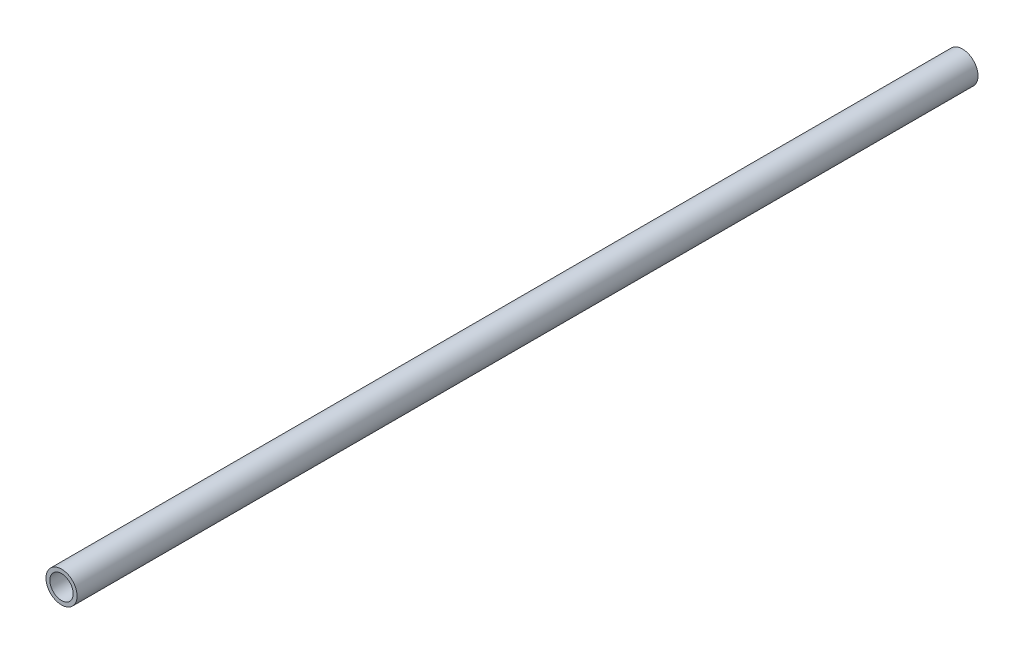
ISO-10303-21;
HEADER;
FILE_DESCRIPTION(('STEP AP214'),'2;1');
FILE_NAME('part.step','',(''),(''),'','','');
FILE_SCHEMA(('AUTOMOTIVE_DESIGN { 1 0 10303 214 1 1 1 1 }'));
ENDSEC;
DATA;
#1=APPLICATION_CONTEXT('core data for automotive mechanical design processes');
#2=APPLICATION_PROTOCOL_DEFINITION('international standard','automotive_design',2000,#1);
#3=PRODUCT_CONTEXT('',#1,'mechanical');
#4=PRODUCT('Part','Part','',(#3));
#5=PRODUCT_RELATED_PRODUCT_CATEGORY('part','',(#4));
#6=PRODUCT_DEFINITION_FORMATION('','',#4);
#7=PRODUCT_DEFINITION_CONTEXT('part definition',#1,'design');
#8=PRODUCT_DEFINITION('design','',#6,#7);
#9=PRODUCT_DEFINITION_SHAPE('','',#8);
#10=(LENGTH_UNIT() NAMED_UNIT(*) SI_UNIT(.MILLI.,.METRE.));
#11=(NAMED_UNIT(*) PLANE_ANGLE_UNIT() SI_UNIT($,.RADIAN.));
#12=(NAMED_UNIT(*) SI_UNIT($,.STERADIAN.) SOLID_ANGLE_UNIT());
#13=UNCERTAINTY_MEASURE_WITH_UNIT(LENGTH_MEASURE(1.E-05),#10,'distance_accuracy_value','');
#14=(GEOMETRIC_REPRESENTATION_CONTEXT(3) GLOBAL_UNCERTAINTY_ASSIGNED_CONTEXT((#13)) GLOBAL_UNIT_ASSIGNED_CONTEXT((#10,
#11,#12)) REPRESENTATION_CONTEXT('',''));
#15=CARTESIAN_POINT('',(0.,0.,0.));
#16=DIRECTION('',(0.,0.,1.));
#17=DIRECTION('',(1.,0.,0.));
#18=AXIS2_PLACEMENT_3D('',#15,#16,#17);
#19=CARTESIAN_POINT('',(0.,0.,579.));
#20=DIRECTION('',(0.,0.,1.));
#21=DIRECTION('',(1.,0.,0.));
#22=AXIS2_PLACEMENT_3D('',#19,#20,#21);
#23=PLANE('',#22);
#24=CARTESIAN_POINT('',(0.,0.,579.));
#25=DIRECTION('',(0.,0.,1.));
#26=DIRECTION('',(1.,0.,0.));
#27=AXIS2_PLACEMENT_3D('',#24,#25,#26);
#28=CIRCLE('',#27,10.);
#29=CARTESIAN_POINT('',(10.,0.,579.));
#30=VERTEX_POINT('',#29);
#31=EDGE_CURVE('E10',#30,#30,#28,.T.);
#32=ORIENTED_EDGE('',*,*,#31,.T.);
#33=EDGE_LOOP('',(#32));
#34=FACE_BOUND('',#33,.T.);
#35=CARTESIAN_POINT('',(0.,0.,579.));
#36=DIRECTION('',(0.,0.,1.));
#37=DIRECTION('',(1.,0.,0.));
#38=AXIS2_PLACEMENT_3D('',#35,#36,#37);
#39=CIRCLE('',#38,7.5);
#40=CARTESIAN_POINT('',(7.5,0.,579.));
#41=VERTEX_POINT('',#40);
#42=EDGE_CURVE('E41',#41,#41,#39,.T.);
#43=ORIENTED_EDGE('',*,*,#42,.F.);
#44=EDGE_LOOP('',(#43));
#45=FACE_BOUND('',#44,.T.);
#46=ADVANCED_FACE('F30',(#34,#45),#23,.T.);
#47=CARTESIAN_POINT('',(0.,0.,0.));
#48=DIRECTION('',(0.,0.,1.));
#49=DIRECTION('',(1.,0.,0.));
#50=AXIS2_PLACEMENT_3D('',#47,#48,#49);
#51=PLANE('',#50);
#52=CARTESIAN_POINT('',(0.,0.,0.));
#53=DIRECTION('',(0.,0.,1.));
#54=DIRECTION('',(1.,0.,0.));
#55=AXIS2_PLACEMENT_3D('',#52,#53,#54);
#56=CIRCLE('',#55,10.);
#57=CARTESIAN_POINT('',(10.,0.,0.));
#58=VERTEX_POINT('',#57);
#59=EDGE_CURVE('E34',#58,#58,#56,.T.);
#60=ORIENTED_EDGE('',*,*,#59,.F.);
#61=EDGE_LOOP('',(#60));
#62=FACE_BOUND('',#61,.T.);
#63=CARTESIAN_POINT('',(0.,0.,0.));
#64=DIRECTION('',(0.,0.,1.));
#65=DIRECTION('',(1.,0.,0.));
#66=AXIS2_PLACEMENT_3D('',#63,#64,#65);
#67=CIRCLE('',#66,7.5);
#68=CARTESIAN_POINT('',(7.5,0.,0.));
#69=VERTEX_POINT('',#68);
#70=EDGE_CURVE('E43',#69,#69,#67,.T.);
#71=ORIENTED_EDGE('',*,*,#70,.T.);
#72=EDGE_LOOP('',(#71));
#73=FACE_BOUND('',#72,.T.);
#74=ADVANCED_FACE('F53',(#62,#73),#51,.F.);
#75=CARTESIAN_POINT('',(0.,0.,579.));
#76=DIRECTION('',(0.,0.,-1.));
#77=DIRECTION('',(-1.,0.,0.));
#78=AXIS2_PLACEMENT_3D('',#75,#76,#77);
#79=CYLINDRICAL_SURFACE('',#78,10.);
#80=ORIENTED_EDGE('',*,*,#31,.F.);
#81=EDGE_LOOP('',(#80));
#82=FACE_BOUND('',#81,.T.);
#83=ORIENTED_EDGE('',*,*,#59,.T.);
#84=EDGE_LOOP('',(#83));
#85=FACE_BOUND('',#84,.T.);
#86=ADVANCED_FACE('F32',(#82,#85),#79,.T.);
#87=CARTESIAN_POINT('',(0.,0.,579.));
#88=DIRECTION('',(0.,0.,-1.));
#89=DIRECTION('',(-1.,0.,0.));
#90=AXIS2_PLACEMENT_3D('',#87,#88,#89);
#91=CYLINDRICAL_SURFACE('',#90,7.5);
#92=ORIENTED_EDGE('',*,*,#42,.T.);
#93=EDGE_LOOP('',(#92));
#94=FACE_BOUND('',#93,.T.);
#95=ORIENTED_EDGE('',*,*,#70,.F.);
#96=EDGE_LOOP('',(#95));
#97=FACE_BOUND('',#96,.T.);
#98=ADVANCED_FACE('F49',(#94,#97),#91,.F.);
#99=CLOSED_SHELL('',(#46,#74,#86,#98));
#100=MANIFOLD_SOLID_BREP('B2',#99);
#101=ADVANCED_BREP_SHAPE_REPRESENTATION('',(#18,#100),#14);
#102=SHAPE_DEFINITION_REPRESENTATION(#9,#101);
ENDSEC;
END-ISO-10303-21;
